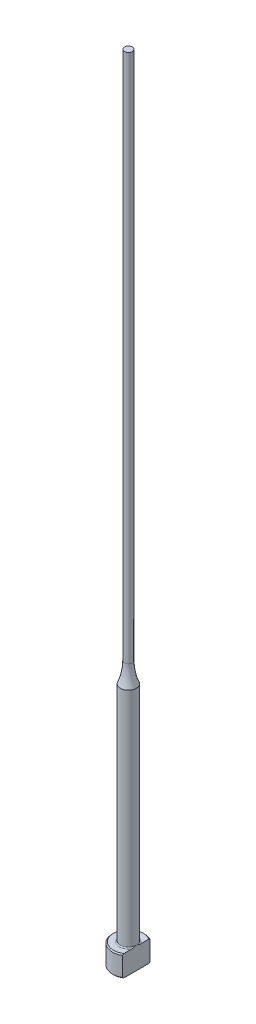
from build123d import *
from build123d.topology import SkipClean

# Parameters (mm, degrees)
CHAMFER1_SIZE    = 0.2
FILLET1_R        = 0.2
KEYED_HEAD_DEPTH = 151.059988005


with BuildPart() as part:
    # Sketch1 → Revolve1 (revolve)
    with BuildSketch(Plane.XY, mode=Mode.PRIVATE) as revolve1_sk:
        with BuildLine():
            Line((0, 0), (-3, 0))
            Line((-3, 0), (-3, 4))
            Line((-3, 4), (-1.5, 4))
            Line((-1.5, 4), (-1.5, 46.200328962))
            ThreePointArc((-1.5, 46.200328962), (-0.939291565, 48.063508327), (-0.75, 50))
            Line((-0.75, 50), (-0.75, 150))
            Line((-0.75, 150), (0, 150))
            Line((0, 150), (0, 0))
        make_face()
    revolve(revolve1_sk.sketch.rotate(Axis((0, 259.958771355, 0), (0, -1, 0)), 270), axis=Axis((0, 259.958771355, 0), (0, -1, 0)))

    # Chamfer1
    chamfer1_edges = [part.edges().sort_by_distance(p)[0] for p in [
        (0, 0, -3),
        (0, 4, -3),
    ]]
    chamfer(chamfer1_edges, length=CHAMFER1_SIZE)

    # Fillet1
    fillet1_edges = [part.edges().sort_by_distance(p)[0] for p in [
        (0, 4, -1.5),
    ]]
    fillet(fillet1_edges, radius=FILLET1_R)

    # Sketch2 → Keyed Head (cut, through all)
    with SkipClean():  # the faces are left unmerged after this step: merging them gives an invalid solid
        with BuildSketch(Plane(origin=(0, 0, 0), x_dir=(1, 0, 0), z_dir=(0, 1, 0))):
            with BuildLine():
                Line((1.5, -2.598076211), (1.5, 2.598076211))
                ThreePointArc((1.5, 2.598076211), (3, 0), (1.5, -2.598076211))
            make_face()
        extrude(amount=KEYED_HEAD_DEPTH, mode=Mode.SUBTRACT)


solid = part.part
